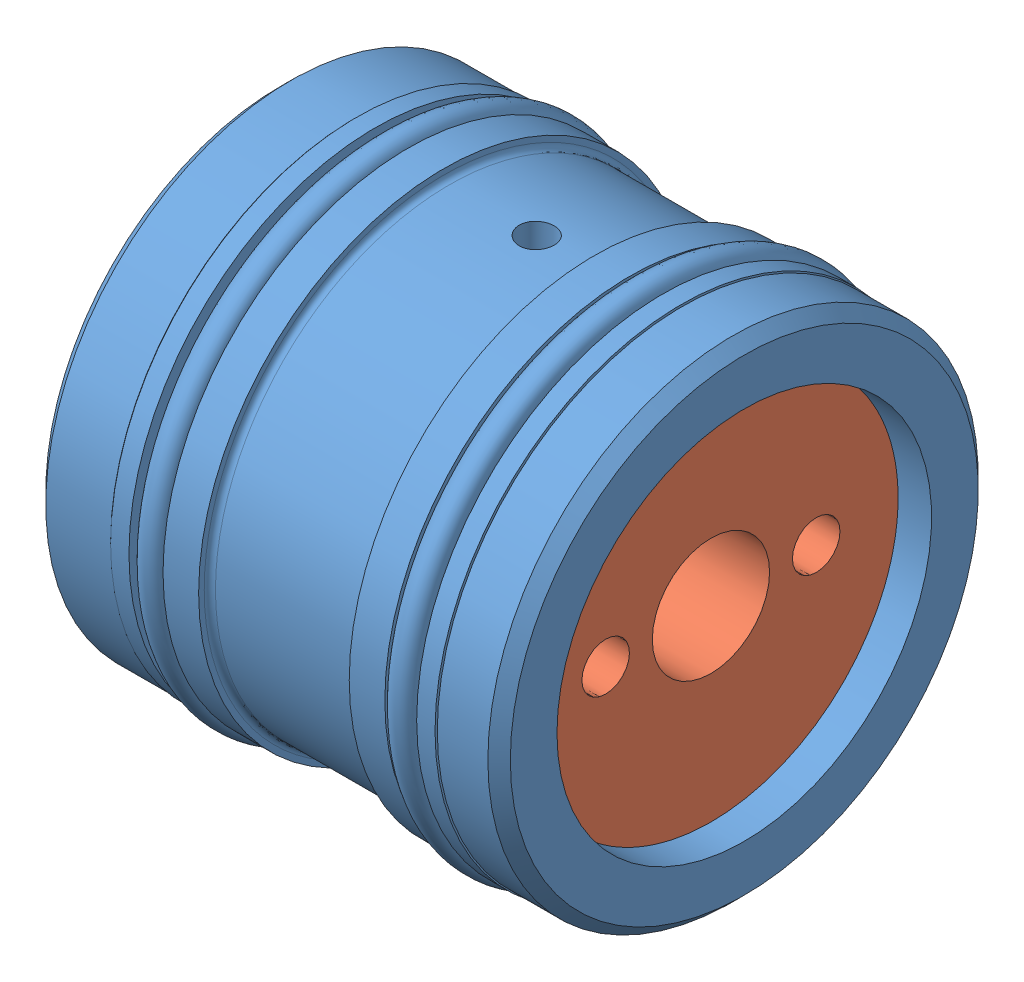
SolidWorks assembly ILC21411101.sldasm, configuration Default (file format 3400). Lengths in mm.
Overall size (38.25 34.11 34.11).
2 component instances, 2 part files, 3 mates.
Components (placement in the parent):
- ILC21411101_BODY-1: ILC21411101_BODY.sldprt [Default] at origin size (31.5 34.11 34.11)
- ILC21411101_PLUNGER-1: ILC21411101_PLUNGER.sldprt [Default] at (13.4874 0 0) x (-1 0 0) z (0 0 1) size (35.99 25.4 25.4)
Mates (geometry in assembly coordinates):
- MID STROKE: distance = 2.2606 mm aligned: plane of ILC21411101_PLUNGER-1 through (13.4874 -3.9751 0) normal (1 0 0); plane of ILC21411101_BODY-1 through (15.748 16.6243 0) normal (1 0 0)
- Coincident2: coincident aligned: unknown of ILC21411101_PLUNGER-1
- Concentric2: concentric anti-aligned: cylinder of ILC21411101_BODY-1; cylinder of ILC21411101_PLUNGER-1
